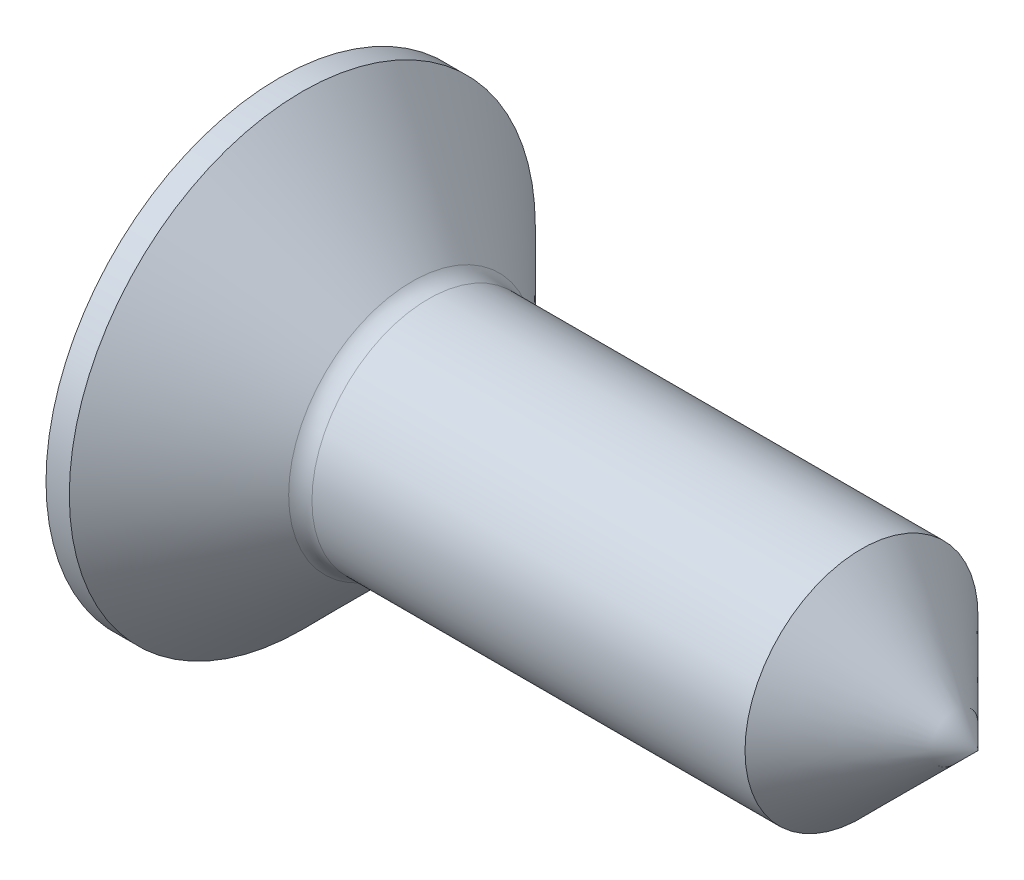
from build123d import *

# Parameters (mm, degrees)
FILLET1_R = 0.2


with BuildPart() as part:
    # Sketch1 → Base (revolve)
    with BuildSketch(Plane(origin=(0, 0, 0), x_dir=(1, 0, 0), z_dir=(0, 1, 0)), mode=Mode.PRIVATE) as base_sk:
        with BuildLine():
            Line((1.8, 1), (6.6, 1))
            Line((6.6, 1), (6.6, 0))
            Line((6.6, 0), (0, 0))
            ThreePointArc((0, 0), (0.153231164, 1.044030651), (0.6, 2))
            Line((0.6, 2), (0.8, 2))
            Line((0.8, 2), (1.8, 1))
        make_face()
    revolve(base_sk.sketch.rotate(Axis((-7.24054878, 0, 0), (1, 0, 0)), 180), axis=Axis((-7.24054878, 0, 0), (1, 0, 0)))

    # Fillet1
    fillet1_edges = [part.edges().sort_by_distance(p)[0] for p in [
        (1.8, 0, -1),
    ]]
    fillet(fillet1_edges, radius=FILLET1_R)

    # Sketch4 → Cut-Revolve1 (revolve, cut)
    with BuildSketch(Plane.XY, mode=Mode.PRIVATE) as cut_revolve1_sk:
        Polygon((7.21, 0), (7.21, 20), (-13.4, 20), (6.6, 0), align=None)
    revolve(cut_revolve1_sk.sketch.rotate(Axis((4.646714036, 0, 0), (1, 0, 0)), 90), axis=Axis((4.646714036, 0, 0), (1, 0, 0)), mode=Mode.SUBTRACT)

    # Sketch3 → Cut-Loft1 section 0
    with BuildSketch(Plane(origin=(0, 0, 0), x_dir=(0, 0, -1), z_dir=(1, 0, 0)), mode=Mode.PRIVATE) as cut_loft1_s0:
        with BuildLine():
            Line((-0.3375, 0.3375), (-1.35, 0.3375))
            Line((-1.35, 0.3375), (-1.35, -0.3375))
            Line((-1.35, -0.3375), (-0.3375, -0.3375))
            Line((-0.3375, -0.3375), (-0.3375, -1.35))
            Line((-0.3375, -1.35), (0.3375, -1.35))
            Line((0.3375, -1.35), (0.3375, -0.3375))
            Line((0.3375, -0.3375), (1.35, -0.3375))
            Line((1.35, -0.3375), (1.35, 0.3375))
            Line((1.35, 0.3375), (0.3375, 0.3375))
            Line((0.3375, 0.3375), (0.3375, 1.35))
            Line((0.3375, 1.35), (-0.3375, 1.35))
            Line((-0.3375, 1.35), (-0.3375, 0.3375))
        make_face()
    loft([cut_loft1_s0.sketch, Vertex(1.65, 0, 0)], mode=Mode.SUBTRACT)


solid = part.part
